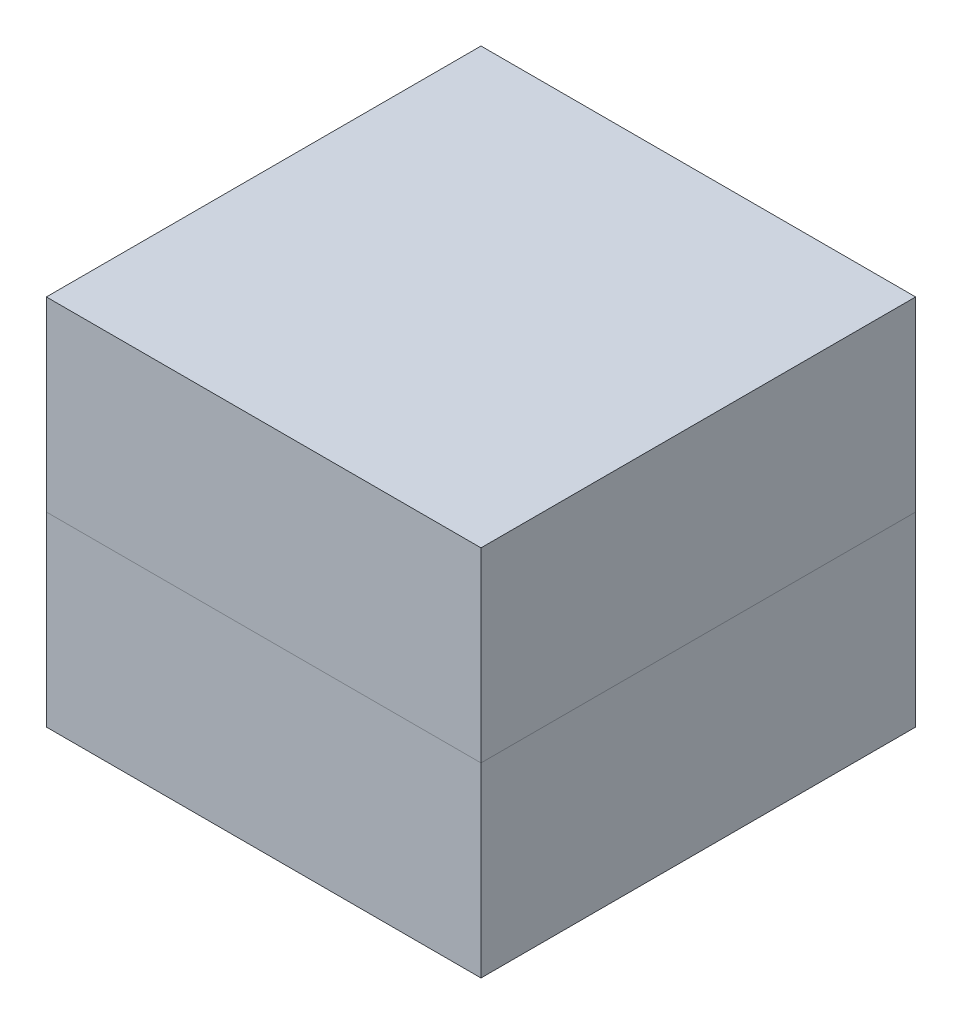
ISO-10303-21;
HEADER;
FILE_DESCRIPTION(('STEP AP214'),'2;1');
FILE_NAME('part.step','',(''),(''),'','','');
FILE_SCHEMA(('AUTOMOTIVE_DESIGN { 1 0 10303 214 1 1 1 1 }'));
ENDSEC;
DATA;
#1=APPLICATION_CONTEXT('core data for automotive mechanical design processes');
#2=APPLICATION_PROTOCOL_DEFINITION('international standard','automotive_design',2000,#1);
#3=PRODUCT_CONTEXT('',#1,'mechanical');
#4=PRODUCT('Part','Part','',(#3));
#5=PRODUCT_RELATED_PRODUCT_CATEGORY('part','',(#4));
#6=PRODUCT_DEFINITION_FORMATION('','',#4);
#7=PRODUCT_DEFINITION_CONTEXT('part definition',#1,'design');
#8=PRODUCT_DEFINITION('design','',#6,#7);
#9=PRODUCT_DEFINITION_SHAPE('','',#8);
#10=(LENGTH_UNIT() NAMED_UNIT(*) SI_UNIT(.MILLI.,.METRE.));
#11=(NAMED_UNIT(*) PLANE_ANGLE_UNIT() SI_UNIT($,.RADIAN.));
#12=(NAMED_UNIT(*) SI_UNIT($,.STERADIAN.) SOLID_ANGLE_UNIT());
#13=UNCERTAINTY_MEASURE_WITH_UNIT(LENGTH_MEASURE(1.E-05),#10,'distance_accuracy_value','');
#14=(GEOMETRIC_REPRESENTATION_CONTEXT(3) GLOBAL_UNCERTAINTY_ASSIGNED_CONTEXT((#13)) GLOBAL_UNIT_ASSIGNED_CONTEXT((#10,
#11,#12)) REPRESENTATION_CONTEXT('',''));
#15=CARTESIAN_POINT('',(0.,0.,0.));
#16=DIRECTION('',(0.,0.,1.));
#17=DIRECTION('',(1.,0.,0.));
#18=AXIS2_PLACEMENT_3D('',#15,#16,#17);
#19=CARTESIAN_POINT('',(17.5,15.,17.5));
#20=DIRECTION('',(-1.,0.,0.));
#21=DIRECTION('',(0.,0.,1.));
#22=AXIS2_PLACEMENT_3D('',#19,#20,#21);
#23=PLANE('',#22);
#24=DIRECTION('',(0.,0.,-1.));
#25=VECTOR('',#24,1.);
#26=CARTESIAN_POINT('',(17.5,0.,17.5));
#27=LINE('',#26,#25);
#28=CARTESIAN_POINT('',(17.5,0.,17.5));
#29=VERTEX_POINT('',#28);
#30=CARTESIAN_POINT('',(17.5,0.,-17.5));
#31=VERTEX_POINT('',#30);
#32=EDGE_CURVE('E589',#29,#31,#27,.T.);
#33=ORIENTED_EDGE('',*,*,#32,.T.);
#34=DIRECTION('',(0.,-1.,0.));
#35=VECTOR('',#34,1.);
#36=CARTESIAN_POINT('',(17.5,15.,-17.5));
#37=LINE('',#36,#35);
#38=CARTESIAN_POINT('',(17.5,15.,-17.5));
#39=VERTEX_POINT('',#38);
#40=EDGE_CURVE('E649',#39,#31,#37,.T.);
#41=ORIENTED_EDGE('',*,*,#40,.F.);
#42=DIRECTION('',(0.,0.,-1.));
#43=VECTOR('',#42,1.);
#44=CARTESIAN_POINT('',(17.5,15.,17.5));
#45=LINE('',#44,#43);
#46=CARTESIAN_POINT('',(17.5,15.,17.5));
#47=VERTEX_POINT('',#46);
#48=EDGE_CURVE('E591',#47,#39,#45,.T.);
#49=ORIENTED_EDGE('',*,*,#48,.F.);
#50=DIRECTION('',(0.,-1.,0.));
#51=VECTOR('',#50,1.);
#52=CARTESIAN_POINT('',(17.5,15.,17.5));
#53=LINE('',#52,#51);
#54=EDGE_CURVE('E579',#47,#29,#53,.T.);
#55=ORIENTED_EDGE('',*,*,#54,.T.);
#56=EDGE_LOOP('',(#33,#41,#49,#55));
#57=FACE_BOUND('',#56,.T.);
#58=ADVANCED_FACE('F47',(#57),#23,.F.);
#59=CARTESIAN_POINT('',(-17.5,15.,-17.5));
#60=DIRECTION('',(0.,0.,1.));
#61=DIRECTION('',(1.,0.,0.));
#62=AXIS2_PLACEMENT_3D('',#59,#60,#61);
#63=PLANE('',#62);
#64=DIRECTION('',(-1.,0.,0.));
#65=VECTOR('',#64,1.);
#66=CARTESIAN_POINT('',(-17.5,0.,-17.5));
#67=LINE('',#66,#65);
#68=CARTESIAN_POINT('',(-17.5,0.,-17.5));
#69=VERTEX_POINT('',#68);
#70=EDGE_CURVE('E592',#31,#69,#67,.T.);
#71=ORIENTED_EDGE('',*,*,#70,.T.);
#72=DIRECTION('',(0.,-1.,0.));
#73=VECTOR('',#72,1.);
#74=CARTESIAN_POINT('',(-17.5,15.,-17.5));
#75=LINE('',#74,#73);
#76=CARTESIAN_POINT('',(-17.5,15.,-17.5));
#77=VERTEX_POINT('',#76);
#78=EDGE_CURVE('E586',#77,#69,#75,.T.);
#79=ORIENTED_EDGE('',*,*,#78,.F.);
#80=DIRECTION('',(-1.,0.,0.));
#81=VECTOR('',#80,1.);
#82=CARTESIAN_POINT('',(-17.5,15.,-17.5));
#83=LINE('',#82,#81);
#84=EDGE_CURVE('E602',#39,#77,#83,.T.);
#85=ORIENTED_EDGE('',*,*,#84,.F.);
#86=ORIENTED_EDGE('',*,*,#40,.T.);
#87=EDGE_LOOP('',(#71,#79,#85,#86));
#88=FACE_BOUND('',#87,.T.);
#89=ADVANCED_FACE('F248',(#88),#63,.F.);
#90=CARTESIAN_POINT('',(-17.5,15.,17.5));
#91=DIRECTION('',(1.,0.,0.));
#92=DIRECTION('',(0.,0.,-1.));
#93=AXIS2_PLACEMENT_3D('',#90,#91,#92);
#94=PLANE('',#93);
#95=DIRECTION('',(0.,0.,1.));
#96=VECTOR('',#95,1.);
#97=CARTESIAN_POINT('',(-17.5,0.,17.5));
#98=LINE('',#97,#96);
#99=CARTESIAN_POINT('',(-17.5,0.,17.5));
#100=VERTEX_POINT('',#99);
#101=EDGE_CURVE('E648',#69,#100,#98,.T.);
#102=ORIENTED_EDGE('',*,*,#101,.T.);
#103=DIRECTION('',(0.,-1.,0.));
#104=VECTOR('',#103,1.);
#105=CARTESIAN_POINT('',(-17.5,15.,17.5));
#106=LINE('',#105,#104);
#107=CARTESIAN_POINT('',(-17.5,15.,17.5));
#108=VERTEX_POINT('',#107);
#109=EDGE_CURVE('E582',#108,#100,#106,.T.);
#110=ORIENTED_EDGE('',*,*,#109,.F.);
#111=DIRECTION('',(0.,0.,1.));
#112=VECTOR('',#111,1.);
#113=CARTESIAN_POINT('',(-17.5,15.,17.5));
#114=LINE('',#113,#112);
#115=EDGE_CURVE('E600',#77,#108,#114,.T.);
#116=ORIENTED_EDGE('',*,*,#115,.F.);
#117=ORIENTED_EDGE('',*,*,#78,.T.);
#118=EDGE_LOOP('',(#102,#110,#116,#117));
#119=FACE_BOUND('',#118,.T.);
#120=ADVANCED_FACE('F255',(#119),#94,.F.);
#121=CARTESIAN_POINT('',(-17.5,15.,17.5));
#122=DIRECTION('',(0.,0.,-1.));
#123=DIRECTION('',(-1.,0.,0.));
#124=AXIS2_PLACEMENT_3D('',#121,#122,#123);
#125=PLANE('',#124);
#126=DIRECTION('',(1.,0.,0.));
#127=VECTOR('',#126,1.);
#128=CARTESIAN_POINT('',(-17.5,0.,17.5));
#129=LINE('',#128,#127);
#130=EDGE_CURVE('E576',#100,#29,#129,.T.);
#131=ORIENTED_EDGE('',*,*,#130,.T.);
#132=ORIENTED_EDGE('',*,*,#54,.F.);
#133=DIRECTION('',(1.,0.,0.));
#134=VECTOR('',#133,1.);
#135=CARTESIAN_POINT('',(-17.5,15.,17.5));
#136=LINE('',#135,#134);
#137=EDGE_CURVE('E440',#108,#47,#136,.T.);
#138=ORIENTED_EDGE('',*,*,#137,.F.);
#139=ORIENTED_EDGE('',*,*,#109,.T.);
#140=EDGE_LOOP('',(#131,#132,#138,#139));
#141=FACE_BOUND('',#140,.T.);
#142=ADVANCED_FACE('F262',(#141),#125,.F.);
#143=CARTESIAN_POINT('',(0.,15.,0.));
#144=DIRECTION('',(0.,-1.,0.));
#145=DIRECTION('',(0.,0.,-1.));
#146=AXIS2_PLACEMENT_3D('',#143,#144,#145);
#147=PLANE('',#146);
#148=ORIENTED_EDGE('',*,*,#48,.T.);
#149=ORIENTED_EDGE('',*,*,#84,.T.);
#150=ORIENTED_EDGE('',*,*,#115,.T.);
#151=ORIENTED_EDGE('',*,*,#137,.T.);
#152=EDGE_LOOP('',(#148,#149,#150,#151));
#153=FACE_BOUND('',#152,.T.);
#154=ADVANCED_FACE('F266',(#153),#147,.F.);
#155=CARTESIAN_POINT('',(0.,0.,0.));
#156=DIRECTION('',(0.,-1.,0.));
#157=DIRECTION('',(0.,0.,-1.));
#158=AXIS2_PLACEMENT_3D('',#155,#156,#157);
#159=PLANE('',#158);
#160=CARTESIAN_POINT('',(0.,0.,0.));
#161=DIRECTION('',(0.,-1.,0.));
#162=DIRECTION('',(0.,0.,-1.));
#163=AXIS2_PLACEMENT_3D('',#160,#161,#162);
#164=CIRCLE('',#163,14.875);
#165=CARTESIAN_POINT('',(0.,0.,-14.875));
#166=VERTEX_POINT('',#165);
#167=EDGE_CURVE('E12',#166,#166,#164,.T.);
#168=ORIENTED_EDGE('',*,*,#167,.F.);
#169=EDGE_LOOP('',(#168));
#170=FACE_BOUND('',#169,.T.);
#171=ORIENTED_EDGE('',*,*,#32,.F.);
#172=ORIENTED_EDGE('',*,*,#130,.F.);
#173=ORIENTED_EDGE('',*,*,#101,.F.);
#174=ORIENTED_EDGE('',*,*,#70,.F.);
#175=EDGE_LOOP('',(#171,#172,#173,#174));
#176=FACE_BOUND('',#175,.T.);
#177=ADVANCED_FACE('F49',(#170,#176),#159,.T.);
#178=CARTESIAN_POINT('',(-4.42989709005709,6.,-0.0404739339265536));
#179=DIRECTION('',(-0.865110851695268,0.342020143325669,-0.366886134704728));
#180=DIRECTION('',(-0.390432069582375,0.,0.92063173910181));
#181=AXIS2_PLACEMENT_3D('',#178,#179,#180);
#182=PLANE('',#181);
#183=DIRECTION('',(0.189535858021,0.900138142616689,0.39220846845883));
#184=VECTOR('',#183,1.);
#185=CARTESIAN_POINT('',(-4.61303963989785,5.89361219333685,0.292195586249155));
#186=LINE('',#185,#184);
#187=CARTESIAN_POINT('',(-4.38007521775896,7.,0.774271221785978));
#188=VERTEX_POINT('',#187);
#189=CARTESIAN_POINT('',(-4.44324414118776,6.7,0.643555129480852));
#190=VERTEX_POINT('',#189);
#191=EDGE_CURVE('E435',#188,#190,#186,.F.);
#192=ORIENTED_EDGE('',*,*,#191,.F.);
#193=DIRECTION('',(0.390432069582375,0.,-0.92063173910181));
#194=VECTOR('',#193,1.);
#195=CARTESIAN_POINT('',(-3.43408154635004,7.,-1.45636469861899));
#196=LINE('',#195,#194);
#197=CARTESIAN_POINT('',(-5.12216433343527,7.,2.52410389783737));
#198=VERTEX_POINT('',#197);
#199=EDGE_CURVE('E386',#188,#198,#196,.F.);
#200=ORIENTED_EDGE('',*,*,#199,.T.);
#201=DIRECTION('',(0.448030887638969,0.855779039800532,-0.25867075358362));
#202=VECTOR('',#201,1.);
#203=CARTESIAN_POINT('',(-5.06940450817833,7.10077598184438,2.49364299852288));
#204=LINE('',#203,#202);
#205=CARTESIAN_POINT('',(-5.27922504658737,6.7,2.61478294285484));
#206=VERTEX_POINT('',#205);
#207=EDGE_CURVE('E400',#206,#198,#204,.T.);
#208=ORIENTED_EDGE('',*,*,#207,.F.);
#209=DIRECTION('',(0.390432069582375,0.,-0.92063173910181));
#210=VECTOR('',#209,1.);
#211=CARTESIAN_POINT('',(-4.19533930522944,6.7,0.0590000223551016));
#212=LINE('',#211,#210);
#213=EDGE_CURVE('E446',#190,#206,#212,.F.);
#214=ORIENTED_EDGE('',*,*,#213,.F.);
#215=EDGE_LOOP('',(#192,#200,#208,#214));
#216=FACE_BOUND('',#215,.T.);
#217=ADVANCED_FACE('F360',(#216),#182,.F.);
#218=CARTESIAN_POINT('',(-5.88897274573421,6.,3.39999999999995));
#219=DIRECTION('',(-0.114822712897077,0.342020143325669,0.932651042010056));
#220=DIRECTION('',(0.,-0.938860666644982,0.344297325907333));
#221=AXIS2_PLACEMENT_3D('',#218,#219,#220);
#222=PLANE('',#221);
#223=DIRECTION('',(0.448030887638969,0.855779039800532,-0.25867075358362));
#224=VECTOR('',#223,1.);
#225=CARTESIAN_POINT('',(-5.38586822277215,5.77974329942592,3.54271152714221));
#226=LINE('',#225,#224);
#227=CARTESIAN_POINT('',(-4.74702026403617,7.,3.17387248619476));
#228=VERTEX_POINT('',#227);
#229=CARTESIAN_POINT('',(-4.90408097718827,6.7,3.26455153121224));
#230=VERTEX_POINT('',#229);
#231=EDGE_CURVE('E390',#228,#230,#226,.F.);
#232=ORIENTED_EDGE('',*,*,#231,.F.);
#233=DIRECTION('',(-0.9925065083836,0.,-0.122191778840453));
#234=VECTOR('',#233,1.);
#235=CARTESIAN_POINT('',(-0.455791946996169,7.,3.70218420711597));
#236=LINE('',#235,#234);
#237=CARTESIAN_POINT('',(-2.86057615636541,7.,3.40612079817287));
#238=VERTEX_POINT('',#237);
#239=EDGE_CURVE('E379',#228,#238,#236,.F.);
#240=ORIENTED_EDGE('',*,*,#239,.T.);
#241=DIRECTION('',(-0.244894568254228,0.900138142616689,-0.360247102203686));
#242=VECTOR('',#241,1.);
#243=CARTESIAN_POINT('',(-2.82230029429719,6.85931266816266,3.46242571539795));
#244=LINE('',#243,#242);
#245=CARTESIAN_POINT('',(-2.77895716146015,6.7,3.52618473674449));
#246=VERTEX_POINT('',#245);
#247=EDGE_CURVE('E404',#246,#238,#244,.T.);
#248=ORIENTED_EDGE('',*,*,#247,.F.);
#249=DIRECTION('',(-0.9925065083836,0.,-0.122191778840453));
#250=VECTOR('',#249,1.);
#251=CARTESIAN_POINT('',(-5.85784082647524,6.7,3.14713002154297));
#252=LINE('',#251,#250);
#253=EDGE_CURVE('E393',#230,#246,#252,.F.);
#254=ORIENTED_EDGE('',*,*,#253,.F.);
#255=EDGE_LOOP('',(#232,#240,#248,#254));
#256=FACE_BOUND('',#255,.T.);
#257=ADVANCED_FACE('F321',(#256),#222,.F.);
#258=CARTESIAN_POINT('',(-5.32845686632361,5.60873322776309,3.07638600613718));
#259=DIRECTION('',(-0.448030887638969,-0.855779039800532,0.25867075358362));
#260=DIRECTION('',(0.885931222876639,-0.463816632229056,0.));
#261=AXIS2_PLACEMENT_3D('',#258,#259,#260);
#262=CYLINDRICAL_SURFACE('',#261,0.5);
#263=CARTESIAN_POINT('',(-4.75713974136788,6.7,2.74653591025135));
#264=DIRECTION('',(0.,1.,0.));
#265=DIRECTION('',(-0.866025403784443,0.,0.499999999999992));
#266=AXIS2_PLACEMENT_3D('',#263,#264,#265);
#267=ELLIPSE('',#266,0.584262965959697,0.5);
#268=EDGE_CURVE('E385',#230,#206,#267,.F.);
#269=ORIENTED_EDGE('',*,*,#268,.T.);
#270=ORIENTED_EDGE('',*,*,#207,.T.);
#271=CARTESIAN_POINT('',(-4.60007902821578,7.,2.65585686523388));
#272=DIRECTION('',(0.,-1.,0.));
#273=DIRECTION('',(-0.866025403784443,0.,0.499999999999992));
#274=AXIS2_PLACEMENT_3D('',#271,#272,#273);
#275=ELLIPSE('',#274,0.584262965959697,0.5);
#276=EDGE_CURVE('E382',#198,#228,#275,.F.);
#277=ORIENTED_EDGE('',*,*,#276,.T.);
#278=ORIENTED_EDGE('',*,*,#231,.T.);
#279=EDGE_LOOP('',(#269,#270,#277,#278));
#280=FACE_BOUND('',#279,.T.);
#281=ADVANCED_FACE('F317',(#280),#262,.F.);
#282=CARTESIAN_POINT('',(-2.17989709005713,6.,3.85664038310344));
#283=DIRECTION('',(0.909489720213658,0.342020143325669,0.236327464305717));
#284=DIRECTION('',(-0.351990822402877,0.936003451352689,0.));
#285=AXIS2_PLACEMENT_3D('',#282,#283,#284);
#286=PLANE('',#285);
#287=DIRECTION('',(-0.244894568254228,0.900138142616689,-0.360247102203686));
#288=VECTOR('',#287,1.);
#289=CARTESIAN_POINT('',(-2.04741240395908,5.89361219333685,3.50074993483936));
#290=LINE('',#289,#288);
#291=CARTESIAN_POINT('',(-2.34841993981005,7.,3.0579590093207));
#292=VERTEX_POINT('',#291);
#293=CARTESIAN_POINT('',(-2.26680094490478,6.7,3.17802294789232));
#294=VERTEX_POINT('',#293);
#295=EDGE_CURVE('E405',#292,#294,#290,.F.);
#296=ORIENTED_EDGE('',*,*,#295,.F.);
#297=DIRECTION('',(-0.251494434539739,0.,0.967858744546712));
#298=VECTOR('',#297,1.);
#299=CARTESIAN_POINT('',(-1.45554254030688,7.,-0.378217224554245));
#300=LINE('',#299,#298);
#301=CARTESIAN_POINT('',(-1.94445935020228,7.,1.50334492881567));
#302=VERTEX_POINT('',#301);
#303=EDGE_CURVE('E395',#292,#302,#300,.F.);
#304=ORIENTED_EDGE('',*,*,#303,.T.);
#305=DIRECTION('',(-0.393994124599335,0.890519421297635,0.227472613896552));
#306=VECTOR('',#305,1.);
#307=CARTESIAN_POINT('',(-1.84105635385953,6.7662848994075,1.44364518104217));
#308=LINE('',#307,#306);
#309=CARTESIAN_POINT('',(-1.81172980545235,6.7,1.42671349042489));
#310=VERTEX_POINT('',#309);
#311=EDGE_CURVE('E409',#310,#302,#308,.T.);
#312=ORIENTED_EDGE('',*,*,#311,.F.);
#313=DIRECTION('',(-0.251494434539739,0.,0.967858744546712));
#314=VECTOR('',#313,1.);
#315=CARTESIAN_POINT('',(-2.42648733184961,6.7,3.79256484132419));
#316=LINE('',#315,#314);
#317=EDGE_CURVE('E453',#294,#310,#316,.F.);
#318=ORIENTED_EDGE('',*,*,#317,.F.);
#319=EDGE_LOOP('',(#296,#304,#312,#318));
#320=FACE_BOUND('',#319,.T.);
#321=ADVANCED_FACE('F320',(#320),#286,.F.);
#322=CARTESIAN_POINT('',(-2.50215726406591,5.72260212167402,3.3825862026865));
#323=DIRECTION('',(0.244894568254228,-0.900138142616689,0.360247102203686));
#324=DIRECTION('',(0.,-0.37156124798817,-0.928408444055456));
#325=AXIS2_PLACEMENT_3D('',#322,#323,#324);
#326=CYLINDRICAL_SURFACE('',#325,0.5);
#327=CARTESIAN_POINT('',(-2.7680713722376,6.7,2.99141873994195));
#328=DIRECTION('',(0.,1.,0.));
#329=DIRECTION('',(0.562194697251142,0.,0.827004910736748));
#330=AXIS2_PLACEMENT_3D('',#327,#328,#329);
#331=ELLIPSE('',#330,0.555470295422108,0.5);
#332=EDGE_CURVE('E398',#294,#246,#331,.F.);
#333=ORIENTED_EDGE('',*,*,#332,.T.);
#334=ORIENTED_EDGE('',*,*,#247,.T.);
#335=CARTESIAN_POINT('',(-2.84969036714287,7.,2.87135480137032));
#336=DIRECTION('',(0.,-1.,0.));
#337=DIRECTION('',(0.562194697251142,0.,0.827004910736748));
#338=AXIS2_PLACEMENT_3D('',#335,#336,#337);
#339=ELLIPSE('',#338,0.555470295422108,0.5);
#340=EDGE_CURVE('E384',#238,#292,#339,.F.);
#341=ORIENTED_EDGE('',*,*,#340,.T.);
#342=ORIENTED_EDGE('',*,*,#295,.T.);
#343=EDGE_LOOP('',(#333,#334,#341,#342));
#344=FACE_BOUND('',#343,.T.);
#345=ADVANCED_FACE('F323',(#344),#326,.F.);
#346=CARTESIAN_POINT('',(-1.38564064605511,6.,0.799999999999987));
#347=DIRECTION('',(0.250079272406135,0.342020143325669,-0.905804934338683));
#348=DIRECTION('',(0.,0.935531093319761,0.353244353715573));
#349=AXIS2_PLACEMENT_3D('',#346,#347,#348);
#350=PLANE('',#349);
#351=DIRECTION('',(-0.393994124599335,0.890519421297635,0.227472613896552));
#352=VECTOR('',#351,1.);
#353=CARTESIAN_POINT('',(-1.77352316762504,5.86843262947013,0.643233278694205));
#354=LINE('',#353,#352);
#355=CARTESIAN_POINT('',(-2.27416457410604,7.,0.932278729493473));
#356=VERTEX_POINT('',#355);
#357=CARTESIAN_POINT('',(-2.14143502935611,6.7,0.85564729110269));
#358=VERTEX_POINT('',#357);
#359=EDGE_CURVE('E445',#356,#358,#354,.F.);
#360=ORIENTED_EDGE('',*,*,#359,.F.);
#361=DIRECTION('',(0.96393747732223,0.,0.266128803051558));
#362=VECTOR('',#361,1.);
#363=CARTESIAN_POINT('',(-0.400225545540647,7.,1.44964542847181));
#364=LINE('',#363,#362);
#365=CARTESIAN_POINT('',(-3.82248015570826,7.,0.504811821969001));
#366=VERTEX_POINT('',#365);
#367=EDGE_CURVE('E408',#356,#366,#364,.F.);
#368=ORIENTED_EDGE('',*,*,#367,.T.);
#369=DIRECTION('',(0.189535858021,0.900138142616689,0.39220846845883));
#370=VECTOR('',#369,1.);
#371=CARTESIAN_POINT('',(-3.88360440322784,6.70971051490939,0.378326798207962));
#372=LINE('',#371,#370);
#373=CARTESIAN_POINT('',(-3.88564907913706,6.7,0.374095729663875));
#374=VERTEX_POINT('',#373);
#375=EDGE_CURVE('E444',#374,#366,#372,.T.);
#376=ORIENTED_EDGE('',*,*,#375,.F.);
#377=DIRECTION('',(0.96393747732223,0.,0.266128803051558));
#378=VECTOR('',#377,1.);
#379=CARTESIAN_POINT('',(-1.45344472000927,6.7,1.04559118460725));
#380=LINE('',#379,#378);
#381=EDGE_CURVE('E450',#358,#374,#380,.F.);
#382=ORIENTED_EDGE('',*,*,#381,.F.);
#383=EDGE_LOOP('',(#360,#368,#376,#382));
#384=FACE_BOUND('',#383,.T.);
#385=ADVANCED_FACE('F315',(#384),#350,.F.);
#386=CARTESIAN_POINT('',(-1.89856280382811,5.6974225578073,1.09613574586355));
#387=DIRECTION('',(0.393994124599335,-0.890519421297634,-0.227472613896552));
#388=DIRECTION('',(0.914493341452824,0.404600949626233,0.));
#389=AXIS2_PLACEMENT_3D('',#386,#387,#388);
#390=CYLINDRICAL_SURFACE('',#389,0.5);
#391=CARTESIAN_POINT('',(-2.34213496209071,6.7,1.35223225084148));
#392=DIRECTION('',(0.,1.,0.));
#393=DIRECTION('',(0.866025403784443,0.,-0.499999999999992));
#394=AXIS2_PLACEMENT_3D('',#391,#392,#393);
#395=ELLIPSE('',#394,0.561470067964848,0.5);
#396=EDGE_CURVE('E412',#358,#310,#395,.F.);
#397=ORIENTED_EDGE('',*,*,#396,.T.);
#398=ORIENTED_EDGE('',*,*,#311,.T.);
#399=CARTESIAN_POINT('',(-2.47486450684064,7.,1.42886368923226));
#400=DIRECTION('',(0.,-1.,0.));
#401=DIRECTION('',(0.866025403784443,0.,-0.499999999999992));
#402=AXIS2_PLACEMENT_3D('',#399,#400,#401);
#403=ELLIPSE('',#402,0.561470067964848,0.5);
#404=EDGE_CURVE('E411',#302,#356,#403,.F.);
#405=ORIENTED_EDGE('',*,*,#404,.T.);
#406=ORIENTED_EDGE('',*,*,#359,.T.);
#407=EDGE_LOOP('',(#397,#398,#405,#406));
#408=FACE_BOUND('',#407,.T.);
#409=ADVANCED_FACE('F311',(#408),#390,.F.);
#410=CARTESIAN_POINT('',(-4.18048421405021,5.72260212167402,0.47563865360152));
#411=DIRECTION('',(-0.189535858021,-0.900138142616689,-0.39220846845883));
#412=DIRECTION('',(0.,0.399448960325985,-0.916755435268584));
#413=AXIS2_PLACEMENT_3D('',#410,#411,#412);
#414=CYLINDRICAL_SURFACE('',#413,0.5);
#415=CARTESIAN_POINT('',(-3.97468030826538,6.7,0.901510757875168));
#416=DIRECTION('',(0.,1.,0.));
#417=DIRECTION('',(-0.435109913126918,0.,-0.900377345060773));
#418=AXIS2_PLACEMENT_3D('',#415,#416,#417);
#419=ELLIPSE('',#418,0.555470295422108,0.5);
#420=EDGE_CURVE('E441',#190,#374,#419,.F.);
#421=ORIENTED_EDGE('',*,*,#420,.T.);
#422=ORIENTED_EDGE('',*,*,#375,.T.);
#423=CARTESIAN_POINT('',(-3.91151138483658,7.,1.03222685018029));
#424=DIRECTION('',(0.,-1.,0.));
#425=DIRECTION('',(-0.435109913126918,0.,-0.900377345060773));
#426=AXIS2_PLACEMENT_3D('',#423,#424,#425);
#427=ELLIPSE('',#426,0.555470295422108,0.5);
#428=EDGE_CURVE('E495',#366,#188,#427,.F.);
#429=ORIENTED_EDGE('',*,*,#428,.T.);
#430=ORIENTED_EDGE('',*,*,#191,.T.);
#431=EDGE_LOOP('',(#421,#422,#429,#430));
#432=FACE_BOUND('',#431,.T.);
#433=ADVANCED_FACE('F307',(#432),#414,.F.);
#434=CARTESIAN_POINT('',(0.,7.,0.));
#435=DIRECTION('',(0.,-1.,0.));
#436=DIRECTION('',(-0.866025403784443,0.,0.499999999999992));
#437=AXIS2_PLACEMENT_3D('',#434,#435,#436);
#438=PLANE('',#437);
#439=ORIENTED_EDGE('',*,*,#239,.F.);
#440=ORIENTED_EDGE('',*,*,#276,.F.);
#441=ORIENTED_EDGE('',*,*,#199,.F.);
#442=ORIENTED_EDGE('',*,*,#428,.F.);
#443=ORIENTED_EDGE('',*,*,#367,.F.);
#444=ORIENTED_EDGE('',*,*,#404,.F.);
#445=ORIENTED_EDGE('',*,*,#303,.F.);
#446=ORIENTED_EDGE('',*,*,#340,.F.);
#447=EDGE_LOOP('',(#439,#440,#441,#442,#443,#444,#445,#446));
#448=FACE_BOUND('',#447,.T.);
#449=ADVANCED_FACE('F310',(#448),#438,.T.);
#450=CARTESIAN_POINT('',(2.17989709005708,6.,3.85664038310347));
#451=DIRECTION('',(0.114822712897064,0.342020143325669,0.932651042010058));
#452=DIRECTION('',(0.,-0.938860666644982,0.344297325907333));
#453=AXIS2_PLACEMENT_3D('',#450,#451,#452);
#454=PLANE('',#453);
#455=DIRECTION('',(0.244894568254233,0.900138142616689,-0.360247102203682));
#456=VECTOR('',#455,1.);
#457=CARTESIAN_POINT('',(2.5595686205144,5.89361219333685,3.84891172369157));
#458=LINE('',#457,#456);
#459=CARTESIAN_POINT('',(2.86057615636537,7.,3.40612079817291));
#460=VERTEX_POINT('',#459);
#461=CARTESIAN_POINT('',(2.7789571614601,6.7,3.52618473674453));
#462=VERTEX_POINT('',#461);
#463=EDGE_CURVE('E426',#460,#462,#458,.F.);
#464=ORIENTED_EDGE('',*,*,#463,.F.);
#465=DIRECTION('',(-0.992506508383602,0.,0.122191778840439));
#466=VECTOR('',#465,1.);
#467=CARTESIAN_POINT('',(0.455791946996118,7.,3.70218420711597));
#468=LINE('',#467,#466);
#469=CARTESIAN_POINT('',(4.74702026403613,7.,3.17387248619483));
#470=VERTEX_POINT('',#469);
#471=EDGE_CURVE('E432',#460,#470,#468,.F.);
#472=ORIENTED_EDGE('',*,*,#471,.T.);
#473=DIRECTION('',(-0.448030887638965,0.855779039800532,-0.258670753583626));
#474=VECTOR('',#473,1.);
#475=CARTESIAN_POINT('',(4.6942604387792,7.10077598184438,3.14341158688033));
#476=LINE('',#475,#474);
#477=CARTESIAN_POINT('',(4.90408097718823,6.7,3.2645515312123));
#478=VERTEX_POINT('',#477);
#479=EDGE_CURVE('E473',#478,#470,#476,.T.);
#480=ORIENTED_EDGE('',*,*,#479,.F.);
#481=DIRECTION('',(-0.992506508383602,0.,0.122191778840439));
#482=VECTOR('',#481,1.);
#483=CARTESIAN_POINT('',(2.14876517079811,6.7,3.60377040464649));
#484=LINE('',#483,#482);
#485=EDGE_CURVE('E193',#462,#478,#484,.F.);
#486=ORIENTED_EDGE('',*,*,#485,.F.);
#487=EDGE_LOOP('',(#464,#472,#480,#486));
#488=FACE_BOUND('',#487,.T.);
#489=ADVANCED_FACE('F345',(#488),#454,.F.);
#490=CARTESIAN_POINT('',(5.88897274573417,6.,3.40000000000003));
#491=DIRECTION('',(0.865110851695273,0.342020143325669,-0.366886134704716));
#492=DIRECTION('',(-0.390432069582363,0.,-0.920631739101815));
#493=AXIS2_PLACEMENT_3D('',#490,#491,#492);
#494=PLANE('',#493);
#495=DIRECTION('',(-0.448030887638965,0.855779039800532,-0.258670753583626));
#496=VECTOR('',#495,1.);
#497=CARTESIAN_POINT('',(5.76101229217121,5.77974329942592,2.8929429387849));
#498=LINE('',#497,#496);
#499=CARTESIAN_POINT('',(5.12216433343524,7.,2.52410389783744));
#500=VERTEX_POINT('',#499);
#501=CARTESIAN_POINT('',(5.27922504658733,6.7,2.61478294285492));
#502=VERTEX_POINT('',#501);
#503=EDGE_CURVE('E202',#500,#502,#498,.F.);
#504=ORIENTED_EDGE('',*,*,#503,.F.);
#505=DIRECTION('',(0.390432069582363,0.,0.920631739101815));
#506=VECTOR('',#505,1.);
#507=CARTESIAN_POINT('',(3.43408154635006,7.,-1.45636469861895));
#508=LINE('',#507,#506);
#509=CARTESIAN_POINT('',(4.38007521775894,7.,0.77427122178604));
#510=VERTEX_POINT('',#509);
#511=EDGE_CURVE('E174',#500,#510,#508,.F.);
#512=ORIENTED_EDGE('',*,*,#511,.T.);
#513=DIRECTION('',(-0.189535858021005,0.900138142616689,0.392208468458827));
#514=VECTOR('',#513,1.);
#515=CARTESIAN_POINT('',(4.40969877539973,6.85931266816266,0.712970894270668));
#516=LINE('',#515,#514);
#517=CARTESIAN_POINT('',(4.44324414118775,6.7,0.643555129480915));
#518=VERTEX_POINT('',#517);
#519=EDGE_CURVE('E167',#518,#510,#516,.T.);
#520=ORIENTED_EDGE('',*,*,#519,.F.);
#521=DIRECTION('',(0.390432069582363,0.,0.920631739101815));
#522=VECTOR('',#521,1.);
#523=CARTESIAN_POINT('',(5.65441496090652,6.7,3.49947395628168));
#524=LINE('',#523,#522);
#525=EDGE_CURVE('E172',#502,#518,#524,.F.);
#526=ORIENTED_EDGE('',*,*,#525,.F.);
#527=EDGE_LOOP('',(#504,#512,#520,#526));
#528=FACE_BOUND('',#527,.T.);
#529=ADVANCED_FACE('F170',(#528),#494,.F.);
#530=CARTESIAN_POINT('',(5.32845686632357,5.60873322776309,3.07638600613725));
#531=DIRECTION('',(0.448030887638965,-0.855779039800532,0.258670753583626));
#532=DIRECTION('',(0.88593122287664,0.463816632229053,0.));
#533=AXIS2_PLACEMENT_3D('',#530,#531,#532);
#534=CYLINDRICAL_SURFACE('',#533,0.5);
#535=CARTESIAN_POINT('',(4.75713974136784,6.7,2.74653591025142));
#536=DIRECTION('',(0.,1.,0.));
#537=DIRECTION('',(0.866025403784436,0.,0.500000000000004));
#538=AXIS2_PLACEMENT_3D('',#535,#536,#537);
#539=ELLIPSE('',#538,0.584262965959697,0.5);
#540=EDGE_CURVE('E190',#502,#478,#539,.F.);
#541=ORIENTED_EDGE('',*,*,#540,.T.);
#542=ORIENTED_EDGE('',*,*,#479,.T.);
#543=CARTESIAN_POINT('',(4.60007902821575,7.,2.65585686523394));
#544=DIRECTION('',(0.,-1.,0.));
#545=DIRECTION('',(0.866025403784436,0.,0.500000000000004));
#546=AXIS2_PLACEMENT_3D('',#543,#544,#545);
#547=ELLIPSE('',#546,0.584262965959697,0.5);
#548=EDGE_CURVE('E475',#470,#500,#547,.F.);
#549=ORIENTED_EDGE('',*,*,#548,.T.);
#550=ORIENTED_EDGE('',*,*,#503,.T.);
#551=EDGE_LOOP('',(#541,#542,#549,#550));
#552=FACE_BOUND('',#551,.T.);
#553=ADVANCED_FACE('F300',(#552),#534,.F.);
#554=CARTESIAN_POINT('',(4.4298970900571,6.,-0.0404739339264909));
#555=DIRECTION('',(-0.250079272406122,0.342020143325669,-0.905804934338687));
#556=DIRECTION('',(0.,0.935531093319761,0.353244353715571));
#557=AXIS2_PLACEMENT_3D('',#554,#555,#556);
#558=PLANE('',#557);
#559=DIRECTION('',(-0.189535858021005,0.900138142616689,0.392208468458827));
#560=VECTOR('',#559,1.);
#561=CARTESIAN_POINT('',(4.05544457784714,5.89361219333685,0.0227361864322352));
#562=LINE('',#561,#560);
#563=CARTESIAN_POINT('',(3.82248015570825,7.,0.504811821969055));
#564=VERTEX_POINT('',#563);
#565=CARTESIAN_POINT('',(3.88564907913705,6.7,0.37409572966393));
#566=VERTEX_POINT('',#565);
#567=EDGE_CURVE('E197',#564,#566,#562,.F.);
#568=ORIENTED_EDGE('',*,*,#567,.F.);
#569=DIRECTION('',(0.963937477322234,0.,-0.266128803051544));
#570=VECTOR('',#569,1.);
#571=CARTESIAN_POINT('',(0.400225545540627,7.,1.44964542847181));
#572=LINE('',#571,#570);
#573=CARTESIAN_POINT('',(2.27416457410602,7.,0.932278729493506));
#574=VERTEX_POINT('',#573);
#575=EDGE_CURVE('E199',#564,#574,#572,.F.);
#576=ORIENTED_EDGE('',*,*,#575,.T.);
#577=DIRECTION('',(0.393994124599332,0.890519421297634,0.227472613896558));
#578=VECTOR('',#577,1.);
#579=CARTESIAN_POINT('',(2.17076157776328,6.7662848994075,0.872578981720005));
#580=LINE('',#579,#578);
#581=CARTESIAN_POINT('',(2.1414350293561,6.7,0.855647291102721));
#582=VERTEX_POINT('',#581);
#583=EDGE_CURVE('E472',#582,#574,#580,.T.);
#584=ORIENTED_EDGE('',*,*,#583,.F.);
#585=DIRECTION('',(0.963937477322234,0.,-0.266128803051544));
#586=VECTOR('',#585,1.);
#587=CARTESIAN_POINT('',(4.49770116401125,6.7,0.205117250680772));
#588=LINE('',#587,#586);
#589=EDGE_CURVE('E192',#566,#582,#588,.F.);
#590=ORIENTED_EDGE('',*,*,#589,.F.);
#591=EDGE_LOOP('',(#568,#576,#584,#590));
#592=FACE_BOUND('',#591,.T.);
#593=ADVANCED_FACE('F303',(#592),#558,.F.);
#594=CARTESIAN_POINT('',(4.18048421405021,5.72260212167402,0.475638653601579));
#595=DIRECTION('',(0.189535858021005,-0.900138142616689,-0.392208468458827));
#596=DIRECTION('',(0.,0.399448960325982,-0.916755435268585));
#597=AXIS2_PLACEMENT_3D('',#594,#595,#596);
#598=CYLINDRICAL_SURFACE('',#597,0.5);
#599=CARTESIAN_POINT('',(3.97468030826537,6.7,0.901510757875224));
#600=DIRECTION('',(0.,1.,0.));
#601=DIRECTION('',(0.435109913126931,0.,-0.900377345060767));
#602=AXIS2_PLACEMENT_3D('',#599,#600,#601);
#603=ELLIPSE('',#602,0.555470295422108,0.5);
#604=EDGE_CURVE('E179',#566,#518,#603,.F.);
#605=ORIENTED_EDGE('',*,*,#604,.T.);
#606=ORIENTED_EDGE('',*,*,#519,.T.);
#607=CARTESIAN_POINT('',(3.91151138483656,7.,1.03222685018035));
#608=DIRECTION('',(0.,-1.,0.));
#609=DIRECTION('',(0.435109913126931,0.,-0.900377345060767));
#610=AXIS2_PLACEMENT_3D('',#607,#608,#609);
#611=ELLIPSE('',#610,0.555470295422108,0.5);
#612=EDGE_CURVE('E178',#510,#564,#611,.F.);
#613=ORIENTED_EDGE('',*,*,#612,.T.);
#614=ORIENTED_EDGE('',*,*,#567,.T.);
#615=EDGE_LOOP('',(#605,#606,#613,#614));
#616=FACE_BOUND('',#615,.T.);
#617=ADVANCED_FACE('F195',(#616),#598,.F.);
#618=CARTESIAN_POINT('',(1.3856406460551,6.,0.800000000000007));
#619=DIRECTION('',(-0.909489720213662,0.342020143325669,0.236327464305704));
#620=DIRECTION('',(-0.351990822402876,-0.93600345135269,0.));
#621=AXIS2_PLACEMENT_3D('',#618,#619,#620);
#622=PLANE('',#621);
#623=DIRECTION('',(0.393994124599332,0.890519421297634,0.227472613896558));
#624=VECTOR('',#623,1.);
#625=CARTESIAN_POINT('',(1.44381794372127,5.86843262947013,1.21429947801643));
#626=LINE('',#625,#624);
#627=CARTESIAN_POINT('',(1.94445935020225,7.,1.5033449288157));
#628=VERTEX_POINT('',#627);
#629=CARTESIAN_POINT('',(1.81172980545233,6.7,1.42671349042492));
#630=VERTEX_POINT('',#629);
#631=EDGE_CURVE('E466',#628,#630,#626,.F.);
#632=ORIENTED_EDGE('',*,*,#631,.F.);
#633=DIRECTION('',(-0.251494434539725,0.,-0.967858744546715));
#634=VECTOR('',#633,1.);
#635=CARTESIAN_POINT('',(1.45554254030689,7.,-0.378217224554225));
#636=LINE('',#635,#634);
#637=CARTESIAN_POINT('',(2.34841993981,7.,3.05795900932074));
#638=VERTEX_POINT('',#637);
#639=EDGE_CURVE('E427',#628,#638,#636,.F.);
#640=ORIENTED_EDGE('',*,*,#639,.T.);
#641=DIRECTION('',(0.244894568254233,0.900138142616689,-0.360247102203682));
#642=VECTOR('',#641,1.);
#643=CARTESIAN_POINT('',(2.26944281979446,6.70971051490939,3.17413667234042));
#644=LINE('',#643,#642);
#645=CARTESIAN_POINT('',(2.26680094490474,6.7,3.17802294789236));
#646=VERTEX_POINT('',#645);
#647=EDGE_CURVE('E465',#646,#638,#644,.T.);
#648=ORIENTED_EDGE('',*,*,#647,.F.);
#649=DIRECTION('',(-0.251494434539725,0.,-0.967858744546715));
#650=VECTOR('',#649,1.);
#651=CARTESIAN_POINT('',(1.63223088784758,6.7,0.735924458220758));
#652=LINE('',#651,#650);
#653=EDGE_CURVE('E212',#630,#646,#652,.F.);
#654=ORIENTED_EDGE('',*,*,#653,.F.);
#655=EDGE_LOOP('',(#632,#640,#648,#654));
#656=FACE_BOUND('',#655,.T.);
#657=ADVANCED_FACE('F298',(#656),#622,.F.);
#658=CARTESIAN_POINT('',(1.8985628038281,5.6974225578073,1.09613574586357));
#659=DIRECTION('',(-0.393994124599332,-0.890519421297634,-0.227472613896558));
#660=DIRECTION('',(0.914493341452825,-0.40460094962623,0.));
#661=AXIS2_PLACEMENT_3D('',#658,#659,#660);
#662=CYLINDRICAL_SURFACE('',#661,0.5);
#663=CARTESIAN_POINT('',(2.3421349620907,6.7,1.35223225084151));
#664=DIRECTION('',(0.,1.,0.));
#665=DIRECTION('',(-0.866025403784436,0.,-0.500000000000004));
#666=AXIS2_PLACEMENT_3D('',#663,#664,#665);
#667=ELLIPSE('',#666,0.561470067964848,0.5);
#668=EDGE_CURVE('E429',#630,#582,#667,.F.);
#669=ORIENTED_EDGE('',*,*,#668,.T.);
#670=ORIENTED_EDGE('',*,*,#583,.T.);
#671=CARTESIAN_POINT('',(2.47486450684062,7.,1.4288636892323));
#672=DIRECTION('',(0.,-1.,0.));
#673=DIRECTION('',(-0.866025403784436,0.,-0.500000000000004));
#674=AXIS2_PLACEMENT_3D('',#671,#672,#673);
#675=ELLIPSE('',#674,0.561470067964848,0.5);
#676=EDGE_CURVE('E484',#574,#628,#675,.F.);
#677=ORIENTED_EDGE('',*,*,#676,.T.);
#678=ORIENTED_EDGE('',*,*,#631,.T.);
#679=EDGE_LOOP('',(#669,#670,#677,#678));
#680=FACE_BOUND('',#679,.T.);
#681=ADVANCED_FACE('F294',(#680),#662,.F.);
#682=CARTESIAN_POINT('',(2.50215726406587,5.72260212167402,3.38258620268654));
#683=DIRECTION('',(-0.244894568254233,-0.900138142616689,0.360247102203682));
#684=DIRECTION('',(0.,-0.371561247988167,-0.928408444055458));
#685=AXIS2_PLACEMENT_3D('',#682,#683,#684);
#686=CYLINDRICAL_SURFACE('',#685,0.5);
#687=CARTESIAN_POINT('',(2.76807137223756,6.7,2.99141873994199));
#688=DIRECTION('',(0.,1.,0.));
#689=DIRECTION('',(-0.562194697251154,0.,0.827004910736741));
#690=AXIS2_PLACEMENT_3D('',#687,#688,#689);
#691=ELLIPSE('',#690,0.555470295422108,0.5);
#692=EDGE_CURVE('E462',#462,#646,#691,.F.);
#693=ORIENTED_EDGE('',*,*,#692,.T.);
#694=ORIENTED_EDGE('',*,*,#647,.T.);
#695=CARTESIAN_POINT('',(2.84969036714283,7.,2.87135480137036));
#696=DIRECTION('',(0.,-1.,0.));
#697=DIRECTION('',(-0.562194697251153,0.,0.82700491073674));
#698=AXIS2_PLACEMENT_3D('',#695,#696,#697);
#699=ELLIPSE('',#698,0.555470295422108,0.5);
#700=EDGE_CURVE('E486',#638,#460,#699,.F.);
#701=ORIENTED_EDGE('',*,*,#700,.T.);
#702=ORIENTED_EDGE('',*,*,#463,.T.);
#703=EDGE_LOOP('',(#693,#694,#701,#702));
#704=FACE_BOUND('',#703,.T.);
#705=ADVANCED_FACE('F290',(#704),#686,.F.);
#706=CARTESIAN_POINT('',(0.,7.,0.));
#707=DIRECTION('',(0.,-1.,0.));
#708=DIRECTION('',(0.866025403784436,0.,0.500000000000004));
#709=AXIS2_PLACEMENT_3D('',#706,#707,#708);
#710=PLANE('',#709);
#711=ORIENTED_EDGE('',*,*,#511,.F.);
#712=ORIENTED_EDGE('',*,*,#548,.F.);
#713=ORIENTED_EDGE('',*,*,#471,.F.);
#714=ORIENTED_EDGE('',*,*,#700,.F.);
#715=ORIENTED_EDGE('',*,*,#639,.F.);
#716=ORIENTED_EDGE('',*,*,#676,.F.);
#717=ORIENTED_EDGE('',*,*,#575,.F.);
#718=ORIENTED_EDGE('',*,*,#612,.F.);
#719=EDGE_LOOP('',(#711,#712,#713,#714,#715,#716,#717,#718));
#720=FACE_BOUND('',#719,.T.);
#721=ADVANCED_FACE('F293',(#720),#710,.T.);
#722=CARTESIAN_POINT('',(2.25,6.,-3.81616644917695));
#723=DIRECTION('',(0.750288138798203,0.342020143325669,-0.565764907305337));
#724=DIRECTION('',(-0.602074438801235,0.,-0.79843996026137));
#725=AXIS2_PLACEMENT_3D('',#722,#723,#724);
#726=PLANE('',#725);
#727=DIRECTION('',(-0.434430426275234,0.900138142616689,-0.0319613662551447));
#728=VECTOR('',#727,1.);
#729=CARTESIAN_POINT('',(2.05347101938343,5.89361219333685,-4.14110730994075));
#730=LINE('',#729,#728);
#731=CARTESIAN_POINT('',(1.51949906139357,7.,-4.18039201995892));
#732=VERTEX_POINT('',#731);
#733=CARTESIAN_POINT('',(1.66428697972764,6.7,-4.16973986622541));
#734=VERTEX_POINT('',#733);
#735=EDGE_CURVE('E449',#732,#734,#730,.F.);
#736=ORIENTED_EDGE('',*,*,#735,.F.);
#737=DIRECTION('',(0.602074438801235,0.,0.79843996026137));
#738=VECTOR('',#737,1.);
#739=CARTESIAN_POINT('',(2.97828959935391,7.,-2.24581950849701));
#740=LINE('',#739,#738);
#741=CARTESIAN_POINT('',(0.375144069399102,7.,-5.69797638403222));
#742=VERTEX_POINT('',#741);
#743=EDGE_CURVE('E423',#732,#742,#740,.F.);
#744=ORIENTED_EDGE('',*,*,#743,.T.);
#745=DIRECTION('',(0.,0.855779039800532,0.517341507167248));
#746=VECTOR('',#745,1.);
#747=CARTESIAN_POINT('',(0.375144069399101,7.10077598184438,-5.63705458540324));
#748=LINE('',#747,#746);
#749=CARTESIAN_POINT('',(0.375144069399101,6.7,-5.87933447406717));
#750=VERTEX_POINT('',#749);
#751=EDGE_CURVE('E224',#750,#742,#748,.T.);
#752=ORIENTED_EDGE('',*,*,#751,.F.);
#753=DIRECTION('',(0.602074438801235,0.,0.79843996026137));
#754=VECTOR('',#753,1.);
#755=CARTESIAN_POINT('',(2.04657413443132,6.7,-3.66277042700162));
#756=LINE('',#755,#754);
#757=EDGE_CURVE('E209',#734,#750,#756,.F.);
#758=ORIENTED_EDGE('',*,*,#757,.F.);
#759=EDGE_LOOP('',(#736,#744,#752,#758));
#760=FACE_BOUND('',#759,.T.);
#761=ADVANCED_FACE('F329',(#760),#726,.F.);
#762=CARTESIAN_POINT('',(0.,6.,-6.8));
#763=DIRECTION('',(-0.750288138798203,0.342020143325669,-0.565764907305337));
#764=DIRECTION('',(-0.602074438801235,0.,0.79843996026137));
#765=AXIS2_PLACEMENT_3D('',#762,#763,#764);
#766=PLANE('',#765);
#767=DIRECTION('',(0.,0.855779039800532,0.517341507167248));
#768=VECTOR('',#767,1.);
#769=CARTESIAN_POINT('',(-0.375144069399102,5.77974329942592,-6.43565446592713));
#770=LINE('',#769,#768);
#771=CARTESIAN_POINT('',(-0.375144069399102,7.,-5.69797638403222));
#772=VERTEX_POINT('',#771);
#773=CARTESIAN_POINT('',(-0.375144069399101,6.7,-5.87933447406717));
#774=VERTEX_POINT('',#773);
#775=EDGE_CURVE('E420',#772,#774,#770,.F.);
#776=ORIENTED_EDGE('',*,*,#775,.F.);
#777=DIRECTION('',(0.602074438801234,0.,-0.79843996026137));
#778=VECTOR('',#777,1.);
#779=CARTESIAN_POINT('',(-2.97828959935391,7.,-2.24581950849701));
#780=LINE('',#779,#778);
#781=CARTESIAN_POINT('',(-1.51949906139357,7.,-4.18039201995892));
#782=VERTEX_POINT('',#781);
#783=EDGE_CURVE('E225',#772,#782,#780,.F.);
#784=ORIENTED_EDGE('',*,*,#783,.T.);
#785=DIRECTION('',(0.434430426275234,0.900138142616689,-0.0319613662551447));
#786=VECTOR('',#785,1.);
#787=CARTESIAN_POINT('',(-1.58739848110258,6.85931266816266,-4.17539660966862));
#788=LINE('',#787,#786);
#789=CARTESIAN_POINT('',(-1.66428697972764,6.7,-4.16973986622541));
#790=VERTEX_POINT('',#789);
#791=EDGE_CURVE('E607',#790,#782,#788,.T.);
#792=ORIENTED_EDGE('',*,*,#791,.F.);
#793=DIRECTION('',(0.602074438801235,0.,-0.79843996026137));
#794=VECTOR('',#793,1.);
#795=CARTESIAN_POINT('',(0.20342586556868,6.7,-6.64660397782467));
#796=LINE('',#795,#794);
#797=EDGE_CURVE('E211',#774,#790,#796,.F.);
#798=ORIENTED_EDGE('',*,*,#797,.F.);
#799=EDGE_LOOP('',(#776,#784,#792,#798));
#800=FACE_BOUND('',#799,.T.);
#801=ADVANCED_FACE('F284',(#800),#766,.F.);
#802=CARTESIAN_POINT('',(0.,5.60873322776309,-6.15277201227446));
#803=DIRECTION('',(0.,-0.855779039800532,-0.517341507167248));
#804=DIRECTION('',(0.,0.517341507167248,-0.855779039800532));
#805=AXIS2_PLACEMENT_3D('',#802,#803,#804);
#806=CYLINDRICAL_SURFACE('',#805,0.5);
#807=CARTESIAN_POINT('',(0.,6.7,-5.49307182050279));
#808=DIRECTION('',(0.,1.,0.));
#809=DIRECTION('',(0.,0.,-1.));
#810=AXIS2_PLACEMENT_3D('',#807,#808,#809);
#811=ELLIPSE('',#810,0.584262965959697,0.5);
#812=EDGE_CURVE('E221',#774,#750,#811,.F.);
#813=ORIENTED_EDGE('',*,*,#812,.T.);
#814=ORIENTED_EDGE('',*,*,#751,.T.);
#815=CARTESIAN_POINT('',(0.,7.,-5.31171373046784));
#816=DIRECTION('',(0.,-1.,0.));
#817=DIRECTION('',(0.,0.,-1.));
#818=AXIS2_PLACEMENT_3D('',#815,#816,#817);
#819=ELLIPSE('',#818,0.584262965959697,0.5);
#820=EDGE_CURVE('E609',#742,#772,#819,.F.);
#821=ORIENTED_EDGE('',*,*,#820,.T.);
#822=ORIENTED_EDGE('',*,*,#775,.T.);
#823=EDGE_LOOP('',(#813,#814,#821,#822));
#824=FACE_BOUND('',#823,.T.);
#825=ADVANCED_FACE('F280',(#824),#806,.F.);
#826=CARTESIAN_POINT('',(-2.25,6.,-3.81616644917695));
#827=DIRECTION('',(-0.659410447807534,0.342020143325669,0.669477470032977));
#828=DIRECTION('',(0.712443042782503,0.,0.701729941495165));
#829=AXIS2_PLACEMENT_3D('',#826,#827,#828);
#830=PLANE('',#829);
#831=DIRECTION('',(0.434430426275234,0.900138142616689,-0.0319613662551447));
#832=VECTOR('',#831,1.);
#833=CARTESIAN_POINT('',(-2.00803217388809,5.89361219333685,-3.52348612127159));
#834=LINE('',#833,#832);
#835=CARTESIAN_POINT('',(-1.47406021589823,7.,-3.56277083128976));
#836=VERTEX_POINT('',#835);
#837=CARTESIAN_POINT('',(-1.6188481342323,6.7,-3.55211867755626));
#838=VERTEX_POINT('',#837);
#839=EDGE_CURVE('E415',#836,#838,#834,.F.);
#840=ORIENTED_EDGE('',*,*,#839,.F.);
#841=DIRECTION('',(-0.712443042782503,0.,-0.701729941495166));
#842=VECTOR('',#841,1.);
#843=CARTESIAN_POINT('',(1.05531699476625,7.,-1.07142820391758));
#844=LINE('',#843,#842);
#845=CARTESIAN_POINT('',(-0.329705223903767,7.,-2.43562365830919));
#846=VERTEX_POINT('',#845);
#847=EDGE_CURVE('E416',#836,#846,#844,.F.);
#848=ORIENTED_EDGE('',*,*,#847,.T.);
#849=DIRECTION('',(0.,0.890519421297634,-0.454945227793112));
#850=VECTOR('',#849,1.);
#851=CARTESIAN_POINT('',(-0.329705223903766,6.7662848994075,-2.31622416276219));
#852=LINE('',#851,#850);
#853=CARTESIAN_POINT('',(-0.329705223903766,6.7,-2.28236078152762));
#854=VERTEX_POINT('',#853);
#855=EDGE_CURVE('E219',#854,#846,#852,.T.);
#856=ORIENTED_EDGE('',*,*,#855,.F.);
#857=DIRECTION('',(-0.712443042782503,0.,-0.701729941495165));
#858=VECTOR('',#857,1.);
#859=CARTESIAN_POINT('',(-2.07121383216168,6.7,-3.99768209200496));
#860=LINE('',#859,#858);
#861=EDGE_CURVE('E215',#838,#854,#860,.F.);
#862=ORIENTED_EDGE('',*,*,#861,.F.);
#863=EDGE_LOOP('',(#840,#848,#856,#862));
#864=FACE_BOUND('',#863,.T.);
#865=ADVANCED_FACE('F283',(#864),#830,.F.);
#866=CARTESIAN_POINT('',(-1.67832694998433,5.72260212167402,-3.85822485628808));
#867=DIRECTION('',(-0.434430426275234,-0.900138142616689,0.0319613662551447));
#868=DIRECTION('',(0.900598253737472,-0.434652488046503,0.));
#869=AXIS2_PLACEMENT_3D('',#866,#867,#868);
#870=CYLINDRICAL_SURFACE('',#869,0.5);
#871=CARTESIAN_POINT('',(-1.20660893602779,6.7,-3.89292949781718));
#872=DIRECTION('',(0.,1.,0.));
#873=DIRECTION('',(-0.997304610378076,0.,0.0733724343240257));
#874=AXIS2_PLACEMENT_3D('',#871,#872,#873);
#875=ELLIPSE('',#874,0.555470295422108,0.5);
#876=EDGE_CURVE('E419',#838,#790,#875,.F.);
#877=ORIENTED_EDGE('',*,*,#876,.T.);
#878=ORIENTED_EDGE('',*,*,#791,.T.);
#879=CARTESIAN_POINT('',(-1.06182101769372,7.,-3.90358165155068));
#880=DIRECTION('',(0.,-1.,0.));
#881=DIRECTION('',(-0.997304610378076,0.,0.0733724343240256));
#882=AXIS2_PLACEMENT_3D('',#879,#880,#881);
#883=ELLIPSE('',#882,0.555470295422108,0.5);
#884=EDGE_CURVE('E616',#782,#836,#883,.F.);
#885=ORIENTED_EDGE('',*,*,#884,.T.);
#886=ORIENTED_EDGE('',*,*,#839,.T.);
#887=EDGE_LOOP('',(#877,#878,#885,#886));
#888=FACE_BOUND('',#887,.T.);
#889=ADVANCED_FACE('F286',(#888),#870,.F.);
#890=CARTESIAN_POINT('',(0.,6.,-1.6));
#891=DIRECTION('',(0.659410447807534,0.342020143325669,0.669477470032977));
#892=DIRECTION('',(0.712443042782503,0.,-0.701729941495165));
#893=AXIS2_PLACEMENT_3D('',#890,#891,#892);
#894=PLANE('',#893);
#895=DIRECTION('',(0.,0.890519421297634,-0.454945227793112));
#896=VECTOR('',#895,1.);
#897=CARTESIAN_POINT('',(0.329705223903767,5.86843262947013,-1.85753275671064));
#898=LINE('',#897,#896);
#899=CARTESIAN_POINT('',(0.329705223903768,7.,-2.43562365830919));
#900=VERTEX_POINT('',#899);
#901=CARTESIAN_POINT('',(0.329705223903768,6.7,-2.28236078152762));
#902=VERTEX_POINT('',#901);
#903=EDGE_CURVE('E208',#900,#902,#898,.F.);
#904=ORIENTED_EDGE('',*,*,#903,.F.);
#905=DIRECTION('',(-0.712443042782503,0.,0.701729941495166));
#906=VECTOR('',#905,1.);
#907=CARTESIAN_POINT('',(-1.05531699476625,7.,-1.07142820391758));
#908=LINE('',#907,#906);
#909=CARTESIAN_POINT('',(1.47406021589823,7.,-3.56277083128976));
#910=VERTEX_POINT('',#909);
#911=EDGE_CURVE('E220',#900,#910,#908,.F.);
#912=ORIENTED_EDGE('',*,*,#911,.T.);
#913=DIRECTION('',(-0.434430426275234,0.900138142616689,-0.0319613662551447));
#914=VECTOR('',#913,1.);
#915=CARTESIAN_POINT('',(1.61416158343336,6.70971051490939,-3.55246347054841));
#916=LINE('',#915,#914);
#917=CARTESIAN_POINT('',(1.6188481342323,6.7,-3.55211867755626));
#918=VERTEX_POINT('',#917);
#919=EDGE_CURVE('E207',#918,#910,#916,.T.);
#920=ORIENTED_EDGE('',*,*,#919,.F.);
#921=DIRECTION('',(-0.712443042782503,0.,0.701729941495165));
#922=VECTOR('',#921,1.);
#923=CARTESIAN_POINT('',(-0.178786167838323,6.7,-1.78151564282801));
#924=LINE('',#923,#922);
#925=EDGE_CURVE('E213',#902,#918,#924,.F.);
#926=ORIENTED_EDGE('',*,*,#925,.F.);
#927=EDGE_LOOP('',(#904,#912,#920,#926));
#928=FACE_BOUND('',#927,.T.);
#929=ADVANCED_FACE('F278',(#928),#894,.F.);
#930=CARTESIAN_POINT('',(0.,5.6974225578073,-2.19227149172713));
#931=DIRECTION('',(0.,-0.890519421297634,0.454945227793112));
#932=DIRECTION('',(0.,-0.454945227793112,-0.890519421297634));
#933=AXIS2_PLACEMENT_3D('',#930,#931,#932);
#934=CYLINDRICAL_SURFACE('',#933,0.5);
#935=CARTESIAN_POINT('',(0.,6.7,-2.704464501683));
#936=DIRECTION('',(0.,1.,0.));
#937=DIRECTION('',(0.,0.,1.));
#938=AXIS2_PLACEMENT_3D('',#935,#936,#937);
#939=ELLIPSE('',#938,0.561470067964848,0.5);
#940=EDGE_CURVE('E216',#902,#854,#939,.F.);
#941=ORIENTED_EDGE('',*,*,#940,.T.);
#942=ORIENTED_EDGE('',*,*,#855,.T.);
#943=CARTESIAN_POINT('',(0.,7.,-2.85772737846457));
#944=DIRECTION('',(0.,-1.,0.));
#945=DIRECTION('',(0.,0.,1.));
#946=AXIS2_PLACEMENT_3D('',#943,#944,#945);
#947=ELLIPSE('',#946,0.561470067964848,0.5);
#948=EDGE_CURVE('E614',#846,#900,#947,.F.);
#949=ORIENTED_EDGE('',*,*,#948,.T.);
#950=ORIENTED_EDGE('',*,*,#903,.T.);
#951=EDGE_LOOP('',(#941,#942,#949,#950));
#952=FACE_BOUND('',#951,.T.);
#953=ADVANCED_FACE('F274',(#952),#934,.F.);
#954=CARTESIAN_POINT('',(1.67832694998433,5.72260212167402,-3.85822485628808));
#955=DIRECTION('',(0.434430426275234,-0.900138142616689,0.0319613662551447));
#956=DIRECTION('',(0.900598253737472,0.434652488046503,0.));
#957=AXIS2_PLACEMENT_3D('',#954,#955,#956);
#958=CYLINDRICAL_SURFACE('',#957,0.5);
#959=CARTESIAN_POINT('',(1.2066089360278,6.7,-3.89292949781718));
#960=DIRECTION('',(0.,1.,0.));
#961=DIRECTION('',(0.997304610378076,0.,0.0733724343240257));
#962=AXIS2_PLACEMENT_3D('',#959,#960,#961);
#963=ELLIPSE('',#962,0.555470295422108,0.5);
#964=EDGE_CURVE('E66',#734,#918,#963,.F.);
#965=ORIENTED_EDGE('',*,*,#964,.T.);
#966=ORIENTED_EDGE('',*,*,#919,.T.);
#967=CARTESIAN_POINT('',(1.06182101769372,7.,-3.90358165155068));
#968=DIRECTION('',(0.,-1.,0.));
#969=DIRECTION('',(0.997304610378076,0.,0.0733724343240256));
#970=AXIS2_PLACEMENT_3D('',#967,#968,#969);
#971=ELLIPSE('',#970,0.555470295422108,0.5);
#972=EDGE_CURVE('E611',#910,#732,#971,.F.);
#973=ORIENTED_EDGE('',*,*,#972,.T.);
#974=ORIENTED_EDGE('',*,*,#735,.T.);
#975=EDGE_LOOP('',(#965,#966,#973,#974));
#976=FACE_BOUND('',#975,.T.);
#977=ADVANCED_FACE('F271',(#976),#958,.F.);
#978=CARTESIAN_POINT('',(0.,7.,0.));
#979=DIRECTION('',(0.,-1.,0.));
#980=DIRECTION('',(0.,0.,-1.));
#981=AXIS2_PLACEMENT_3D('',#978,#979,#980);
#982=PLANE('',#981);
#983=ORIENTED_EDGE('',*,*,#783,.F.);
#984=ORIENTED_EDGE('',*,*,#820,.F.);
#985=ORIENTED_EDGE('',*,*,#743,.F.);
#986=ORIENTED_EDGE('',*,*,#972,.F.);
#987=ORIENTED_EDGE('',*,*,#911,.F.);
#988=ORIENTED_EDGE('',*,*,#948,.F.);
#989=ORIENTED_EDGE('',*,*,#847,.F.);
#990=ORIENTED_EDGE('',*,*,#884,.F.);
#991=EDGE_LOOP('',(#983,#984,#985,#986,#987,#988,#989,#990));
#992=FACE_BOUND('',#991,.T.);
#993=ADVANCED_FACE('F245',(#992),#982,.T.);
#994=CARTESIAN_POINT('',(0.,6.7,-8.85));
#995=DIRECTION('',(0.,1.,0.));
#996=DIRECTION('',(0.,0.,1.));
#997=AXIS2_PLACEMENT_3D('',#994,#995,#996);
#998=PLANE('',#997);
#999=ORIENTED_EDGE('',*,*,#213,.T.);
#1000=ORIENTED_EDGE('',*,*,#268,.F.);
#1001=ORIENTED_EDGE('',*,*,#253,.T.);
#1002=ORIENTED_EDGE('',*,*,#332,.F.);
#1003=ORIENTED_EDGE('',*,*,#317,.T.);
#1004=ORIENTED_EDGE('',*,*,#396,.F.);
#1005=ORIENTED_EDGE('',*,*,#381,.T.);
#1006=ORIENTED_EDGE('',*,*,#420,.F.);
#1007=EDGE_LOOP('',(#999,#1000,#1001,#1002,#1003,#1004,#1005,#1006));
#1008=FACE_BOUND('',#1007,.T.);
#1009=ORIENTED_EDGE('',*,*,#485,.T.);
#1010=ORIENTED_EDGE('',*,*,#540,.F.);
#1011=ORIENTED_EDGE('',*,*,#525,.T.);
#1012=ORIENTED_EDGE('',*,*,#604,.F.);
#1013=ORIENTED_EDGE('',*,*,#589,.T.);
#1014=ORIENTED_EDGE('',*,*,#668,.F.);
#1015=ORIENTED_EDGE('',*,*,#653,.T.);
#1016=ORIENTED_EDGE('',*,*,#692,.F.);
#1017=EDGE_LOOP('',(#1009,#1010,#1011,#1012,#1013,#1014,#1015,#1016));
#1018=FACE_BOUND('',#1017,.T.);
#1019=ORIENTED_EDGE('',*,*,#757,.T.);
#1020=ORIENTED_EDGE('',*,*,#812,.F.);
#1021=ORIENTED_EDGE('',*,*,#797,.T.);
#1022=ORIENTED_EDGE('',*,*,#876,.F.);
#1023=ORIENTED_EDGE('',*,*,#861,.T.);
#1024=ORIENTED_EDGE('',*,*,#940,.F.);
#1025=ORIENTED_EDGE('',*,*,#925,.T.);
#1026=ORIENTED_EDGE('',*,*,#964,.F.);
#1027=EDGE_LOOP('',(#1019,#1020,#1021,#1022,#1023,#1024,#1025,#1026));
#1028=FACE_BOUND('',#1027,.T.);
#1029=CARTESIAN_POINT('',(0.,6.7,0.));
#1030=DIRECTION('',(0.,-1.,0.));
#1031=DIRECTION('',(0.,0.,-1.));
#1032=AXIS2_PLACEMENT_3D('',#1029,#1030,#1031);
#1033=CIRCLE('',#1032,8.85);
#1034=CARTESIAN_POINT('',(0.,6.7,-8.85));
#1035=VERTEX_POINT('',#1034);
#1036=EDGE_CURVE('E51',#1035,#1035,#1033,.T.);
#1037=ORIENTED_EDGE('',*,*,#1036,.T.);
#1038=EDGE_LOOP('',(#1037));
#1039=FACE_BOUND('',#1038,.T.);
#1040=ADVANCED_FACE('F185',(#1008,#1018,#1028,#1039),#998,.F.);
#1041=CARTESIAN_POINT('',(0.,4.7,0.));
#1042=DIRECTION('',(0.,-1.,0.));
#1043=DIRECTION('',(0.,0.,-1.));
#1044=AXIS2_PLACEMENT_3D('',#1041,#1042,#1043);
#1045=TOROIDAL_SURFACE('',#1044,8.85,2.);
#1046=ORIENTED_EDGE('',*,*,#1036,.F.);
#1047=EDGE_LOOP('',(#1046));
#1048=FACE_BOUND('',#1047,.T.);
#1049=CARTESIAN_POINT('',(0.,5.9,0.));
#1050=DIRECTION('',(0.,-1.,0.));
#1051=DIRECTION('',(0.,0.,-1.));
#1052=AXIS2_PLACEMENT_3D('',#1049,#1050,#1051);
#1053=CIRCLE('',#1052,10.45);
#1054=CARTESIAN_POINT('',(0.,5.9,-10.45));
#1055=VERTEX_POINT('',#1054);
#1056=EDGE_CURVE('E57',#1055,#1055,#1053,.T.);
#1057=ORIENTED_EDGE('',*,*,#1056,.T.);
#1058=EDGE_LOOP('',(#1057));
#1059=FACE_BOUND('',#1058,.T.);
#1060=ADVANCED_FACE('F235',(#1048,#1059),#1045,.F.);
#1061=CARTESIAN_POINT('',(0.,0.,0.));
#1062=DIRECTION('',(0.,-1.,0.));
#1063=DIRECTION('',(0.,0.,-1.));
#1064=AXIS2_PLACEMENT_3D('',#1061,#1062,#1063);
#1065=CONICAL_SURFACE('',#1064,14.875,0.643501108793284);
#1066=ORIENTED_EDGE('',*,*,#1056,.F.);
#1067=EDGE_LOOP('',(#1066));
#1068=FACE_BOUND('',#1067,.T.);
#1069=ORIENTED_EDGE('',*,*,#167,.T.);
#1070=EDGE_LOOP('',(#1069));
#1071=FACE_BOUND('',#1070,.T.);
#1072=ADVANCED_FACE('F237',(#1068,#1071),#1065,.F.);
#1073=CLOSED_SHELL('',(#58,#89,#120,#142,#154,#177,#217,#257,#281,#321,#345,#385,#409,#433,#449,
#489,#529,#553,#593,#617,#657,#681,#705,#721,#761,#801,#825,#865,#889,#929,#953,#977,#993,#1040,
#1060,#1072));
#1074=MANIFOLD_SOLID_BREP('B2',#1073);
#1075=CARTESIAN_POINT('',(0.,4.,0.));
#1076=DIRECTION('',(0.,-1.,0.));
#1077=DIRECTION('',(0.,0.,-1.));
#1078=AXIS2_PLACEMENT_3D('',#1075,#1076,#1077);
#1079=PLANE('',#1078);
#1080=CARTESIAN_POINT('',(0.,4.,0.));
#1081=DIRECTION('',(0.,-1.,0.));
#1082=DIRECTION('',(0.,0.,-1.));
#1083=AXIS2_PLACEMENT_3D('',#1080,#1081,#1082);
#1084=CIRCLE('',#1083,7.5);
#1085=CARTESIAN_POINT('',(0.,4.,-7.5));
#1086=VERTEX_POINT('',#1085);
#1087=EDGE_CURVE('E45',#1086,#1086,#1084,.T.);
#1088=ORIENTED_EDGE('',*,*,#1087,.F.);
#1089=EDGE_LOOP('',(#1088));
#1090=FACE_BOUND('',#1089,.T.);
#1091=ADVANCED_FACE('F936',(#1090),#1079,.F.);
#1092=CARTESIAN_POINT('',(0.,4.,0.));
#1093=DIRECTION('',(0.,-1.,0.));
#1094=DIRECTION('',(0.,0.,-1.));
#1095=AXIS2_PLACEMENT_3D('',#1092,#1093,#1094);
#1096=CONICAL_SURFACE('',#1095,7.5,0.643501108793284);
#1097=CARTESIAN_POINT('',(0.,0.,0.));
#1098=DIRECTION('',(0.,-1.,0.));
#1099=DIRECTION('',(0.,0.,-1.));
#1100=AXIS2_PLACEMENT_3D('',#1097,#1098,#1099);
#1101=CIRCLE('',#1100,10.5);
#1102=CARTESIAN_POINT('',(0.,0.,-10.5));
#1103=VERTEX_POINT('',#1102);
#1104=EDGE_CURVE('E944',#1103,#1103,#1101,.T.);
#1105=ORIENTED_EDGE('',*,*,#1104,.F.);
#1106=EDGE_LOOP('',(#1105));
#1107=FACE_BOUND('',#1106,.T.);
#1108=ORIENTED_EDGE('',*,*,#1087,.T.);
#1109=EDGE_LOOP('',(#1108));
#1110=FACE_BOUND('',#1109,.T.);
#1111=ADVANCED_FACE('F1017',(#1107,#1110),#1096,.T.);
#1112=CARTESIAN_POINT('',(17.5,-15.,-17.5));
#1113=DIRECTION('',(-1.,0.,0.));
#1114=DIRECTION('',(0.,0.,1.));
#1115=AXIS2_PLACEMENT_3D('',#1112,#1113,#1114);
#1116=PLANE('',#1115);
#1117=DIRECTION('',(0.,0.,1.));
#1118=VECTOR('',#1117,1.);
#1119=CARTESIAN_POINT('',(17.5,0.,-17.5));
#1120=LINE('',#1119,#1118);
#1121=CARTESIAN_POINT('',(17.5,0.,-17.5));
#1122=VERTEX_POINT('',#1121);
#1123=CARTESIAN_POINT('',(17.5,0.,17.5));
#1124=VERTEX_POINT('',#1123);
#1125=EDGE_CURVE('E1003',#1122,#1124,#1120,.T.);
#1126=ORIENTED_EDGE('',*,*,#1125,.T.);
#1127=DIRECTION('',(0.,1.,0.));
#1128=VECTOR('',#1127,1.);
#1129=CARTESIAN_POINT('',(17.5,-15.,17.5));
#1130=LINE('',#1129,#1128);
#1131=CARTESIAN_POINT('',(17.5,-15.,17.5));
#1132=VERTEX_POINT('',#1131);
#1133=EDGE_CURVE('E994',#1132,#1124,#1130,.T.);
#1134=ORIENTED_EDGE('',*,*,#1133,.F.);
#1135=DIRECTION('',(0.,0.,1.));
#1136=VECTOR('',#1135,1.);
#1137=CARTESIAN_POINT('',(17.5,-15.,-17.5));
#1138=LINE('',#1137,#1136);
#1139=CARTESIAN_POINT('',(17.5,-15.,-17.5));
#1140=VERTEX_POINT('',#1139);
#1141=EDGE_CURVE('E988',#1140,#1132,#1138,.T.);
#1142=ORIENTED_EDGE('',*,*,#1141,.F.);
#1143=DIRECTION('',(0.,1.,0.));
#1144=VECTOR('',#1143,1.);
#1145=CARTESIAN_POINT('',(17.5,-15.,-17.5));
#1146=LINE('',#1145,#1144);
#1147=EDGE_CURVE('E999',#1140,#1122,#1146,.T.);
#1148=ORIENTED_EDGE('',*,*,#1147,.T.);
#1149=EDGE_LOOP('',(#1126,#1134,#1142,#1148));
#1150=FACE_BOUND('',#1149,.T.);
#1151=ADVANCED_FACE('F1020',(#1150),#1116,.F.);
#1152=CARTESIAN_POINT('',(-17.5,-15.,17.5));
#1153=DIRECTION('',(0.,0.,-1.));
#1154=DIRECTION('',(-1.,0.,0.));
#1155=AXIS2_PLACEMENT_3D('',#1152,#1153,#1154);
#1156=PLANE('',#1155);
#1157=DIRECTION('',(-1.,0.,0.));
#1158=VECTOR('',#1157,1.);
#1159=CARTESIAN_POINT('',(-17.5,0.,17.5));
#1160=LINE('',#1159,#1158);
#1161=CARTESIAN_POINT('',(-17.5,0.,17.5));
#1162=VERTEX_POINT('',#1161);
#1163=EDGE_CURVE('E993',#1124,#1162,#1160,.T.);
#1164=ORIENTED_EDGE('',*,*,#1163,.T.);
#1165=DIRECTION('',(0.,1.,0.));
#1166=VECTOR('',#1165,1.);
#1167=CARTESIAN_POINT('',(-17.5,-15.,17.5));
#1168=LINE('',#1167,#1166);
#1169=CARTESIAN_POINT('',(-17.5,-15.,17.5));
#1170=VERTEX_POINT('',#1169);
#1171=EDGE_CURVE('E991',#1170,#1162,#1168,.T.);
#1172=ORIENTED_EDGE('',*,*,#1171,.F.);
#1173=DIRECTION('',(-1.,0.,0.));
#1174=VECTOR('',#1173,1.);
#1175=CARTESIAN_POINT('',(-17.5,-15.,17.5));
#1176=LINE('',#1175,#1174);
#1177=EDGE_CURVE('E983',#1132,#1170,#1176,.T.);
#1178=ORIENTED_EDGE('',*,*,#1177,.F.);
#1179=ORIENTED_EDGE('',*,*,#1133,.T.);
#1180=EDGE_LOOP('',(#1164,#1172,#1178,#1179));
#1181=FACE_BOUND('',#1180,.T.);
#1182=ADVANCED_FACE('F992',(#1181),#1156,.F.);
#1183=CARTESIAN_POINT('',(-17.5,-15.,-17.5));
#1184=DIRECTION('',(1.,0.,0.));
#1185=DIRECTION('',(0.,0.,-1.));
#1186=AXIS2_PLACEMENT_3D('',#1183,#1184,#1185);
#1187=PLANE('',#1186);
#1188=DIRECTION('',(0.,0.,-1.));
#1189=VECTOR('',#1188,1.);
#1190=CARTESIAN_POINT('',(-17.5,0.,-17.5));
#1191=LINE('',#1190,#1189);
#1192=CARTESIAN_POINT('',(-17.5,0.,-17.5));
#1193=VERTEX_POINT('',#1192);
#1194=EDGE_CURVE('E969',#1162,#1193,#1191,.T.);
#1195=ORIENTED_EDGE('',*,*,#1194,.T.);
#1196=DIRECTION('',(0.,1.,0.));
#1197=VECTOR('',#1196,1.);
#1198=CARTESIAN_POINT('',(-17.5,-15.,-17.5));
#1199=LINE('',#1198,#1197);
#1200=CARTESIAN_POINT('',(-17.5,-15.,-17.5));
#1201=VERTEX_POINT('',#1200);
#1202=EDGE_CURVE('E995',#1201,#1193,#1199,.T.);
#1203=ORIENTED_EDGE('',*,*,#1202,.F.);
#1204=DIRECTION('',(0.,0.,-1.));
#1205=VECTOR('',#1204,1.);
#1206=CARTESIAN_POINT('',(-17.5,-15.,-17.5));
#1207=LINE('',#1206,#1205);
#1208=EDGE_CURVE('E986',#1170,#1201,#1207,.T.);
#1209=ORIENTED_EDGE('',*,*,#1208,.F.);
#1210=ORIENTED_EDGE('',*,*,#1171,.T.);
#1211=EDGE_LOOP('',(#1195,#1203,#1209,#1210));
#1212=FACE_BOUND('',#1211,.T.);
#1213=ADVANCED_FACE('F997',(#1212),#1187,.F.);
#1214=CARTESIAN_POINT('',(-17.5,-15.,-17.5));
#1215=DIRECTION('',(0.,0.,1.));
#1216=DIRECTION('',(1.,0.,0.));
#1217=AXIS2_PLACEMENT_3D('',#1214,#1215,#1216);
#1218=PLANE('',#1217);
#1219=DIRECTION('',(1.,0.,0.));
#1220=VECTOR('',#1219,1.);
#1221=CARTESIAN_POINT('',(-17.5,0.,-17.5));
#1222=LINE('',#1221,#1220);
#1223=EDGE_CURVE('E975',#1193,#1122,#1222,.T.);
#1224=ORIENTED_EDGE('',*,*,#1223,.T.);
#1225=ORIENTED_EDGE('',*,*,#1147,.F.);
#1226=DIRECTION('',(1.,0.,0.));
#1227=VECTOR('',#1226,1.);
#1228=CARTESIAN_POINT('',(-17.5,-15.,-17.5));
#1229=LINE('',#1228,#1227);
#1230=EDGE_CURVE('E952',#1201,#1140,#1229,.T.);
#1231=ORIENTED_EDGE('',*,*,#1230,.F.);
#1232=ORIENTED_EDGE('',*,*,#1202,.T.);
#1233=EDGE_LOOP('',(#1224,#1225,#1231,#1232));
#1234=FACE_BOUND('',#1233,.T.);
#1235=ADVANCED_FACE('F1055',(#1234),#1218,.F.);
#1236=CARTESIAN_POINT('',(0.,-15.,0.));
#1237=DIRECTION('',(0.,1.,0.));
#1238=DIRECTION('',(0.,0.,1.));
#1239=AXIS2_PLACEMENT_3D('',#1236,#1237,#1238);
#1240=PLANE('',#1239);
#1241=ORIENTED_EDGE('',*,*,#1141,.T.);
#1242=ORIENTED_EDGE('',*,*,#1177,.T.);
#1243=ORIENTED_EDGE('',*,*,#1208,.T.);
#1244=ORIENTED_EDGE('',*,*,#1230,.T.);
#1245=EDGE_LOOP('',(#1241,#1242,#1243,#1244));
#1246=FACE_BOUND('',#1245,.T.);
#1247=ADVANCED_FACE('F984',(#1246),#1240,.F.);
#1248=CARTESIAN_POINT('',(0.,0.,0.));
#1249=DIRECTION('',(0.,1.,0.));
#1250=DIRECTION('',(0.,0.,1.));
#1251=AXIS2_PLACEMENT_3D('',#1248,#1249,#1250);
#1252=PLANE('',#1251);
#1253=ORIENTED_EDGE('',*,*,#1104,.T.);
#1254=EDGE_LOOP('',(#1253));
#1255=FACE_BOUND('',#1254,.T.);
#1256=ORIENTED_EDGE('',*,*,#1125,.F.);
#1257=ORIENTED_EDGE('',*,*,#1223,.F.);
#1258=ORIENTED_EDGE('',*,*,#1194,.F.);
#1259=ORIENTED_EDGE('',*,*,#1163,.F.);
#1260=EDGE_LOOP('',(#1256,#1257,#1258,#1259));
#1261=FACE_BOUND('',#1260,.T.);
#1262=ADVANCED_FACE('F1014',(#1255,#1261),#1252,.T.);
#1263=CLOSED_SHELL('',(#1091,#1111,#1151,#1182,#1213,#1235,#1247,#1262));
#1264=MANIFOLD_SOLID_BREP('B6_NOT_SHOWN',#1263);
#1265=ADVANCED_BREP_SHAPE_REPRESENTATION('',(#18,#1074,#1264),#14);
#1266=SHAPE_DEFINITION_REPRESENTATION(#9,#1265);
ENDSEC;
END-ISO-10303-21;
